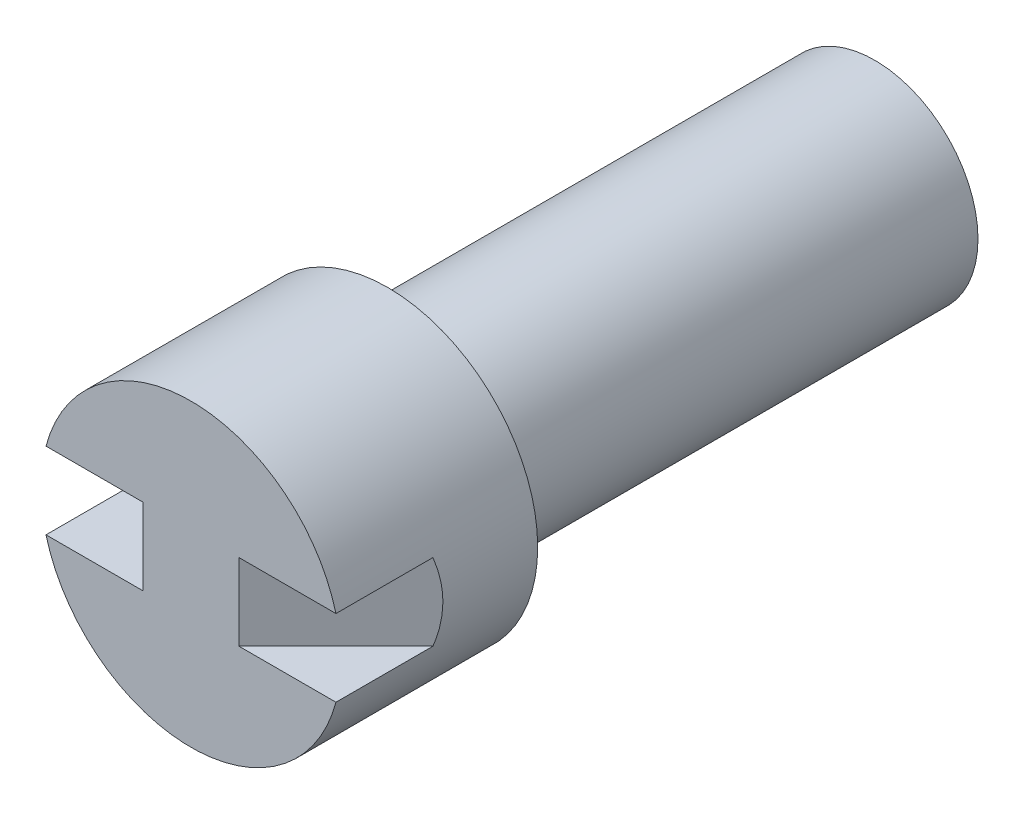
ISO-10303-21;
HEADER;
FILE_DESCRIPTION(('STEP AP214'),'2;1');
FILE_NAME('part.step','',(''),(''),'','','');
FILE_SCHEMA(('AUTOMOTIVE_DESIGN { 1 0 10303 214 1 1 1 1 }'));
ENDSEC;
DATA;
#1=APPLICATION_CONTEXT('core data for automotive mechanical design processes');
#2=APPLICATION_PROTOCOL_DEFINITION('international standard','automotive_design',2000,#1);
#3=PRODUCT_CONTEXT('',#1,'mechanical');
#4=PRODUCT('Part','Part','',(#3));
#5=PRODUCT_RELATED_PRODUCT_CATEGORY('part','',(#4));
#6=PRODUCT_DEFINITION_FORMATION('','',#4);
#7=PRODUCT_DEFINITION_CONTEXT('part definition',#1,'design');
#8=PRODUCT_DEFINITION('design','',#6,#7);
#9=PRODUCT_DEFINITION_SHAPE('','',#8);
#10=(LENGTH_UNIT() NAMED_UNIT(*) SI_UNIT(.MILLI.,.METRE.));
#11=(NAMED_UNIT(*) PLANE_ANGLE_UNIT() SI_UNIT($,.RADIAN.));
#12=(NAMED_UNIT(*) SI_UNIT($,.STERADIAN.) SOLID_ANGLE_UNIT());
#13=UNCERTAINTY_MEASURE_WITH_UNIT(LENGTH_MEASURE(1.E-05),#10,'distance_accuracy_value','');
#14=(GEOMETRIC_REPRESENTATION_CONTEXT(3) GLOBAL_UNCERTAINTY_ASSIGNED_CONTEXT((#13)) GLOBAL_UNIT_ASSIGNED_CONTEXT((#10,
#11,#12)) REPRESENTATION_CONTEXT('',''));
#15=CARTESIAN_POINT('',(0.,0.,0.));
#16=DIRECTION('',(0.,0.,1.));
#17=DIRECTION('',(1.,0.,0.));
#18=AXIS2_PLACEMENT_3D('',#15,#16,#17);
#19=CARTESIAN_POINT('',(0.,0.,0.));
#20=DIRECTION('',(0.,0.,-1.));
#21=DIRECTION('',(-1.,0.,0.));
#22=AXIS2_PLACEMENT_3D('',#19,#20,#21);
#23=PLANE('',#22);
#24=DIRECTION('',(1.,0.,0.));
#25=VECTOR('',#24,1.);
#26=CARTESIAN_POINT('',(0.508,-0.4064,0.));
#27=LINE('',#26,#25);
#28=CARTESIAN_POINT('',(0.508,-0.4064,0.));
#29=VERTEX_POINT('',#28);
#30=CARTESIAN_POINT('',(1.53459939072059,-0.4064,0.));
#31=VERTEX_POINT('',#30);
#32=EDGE_CURVE('E92',#29,#31,#27,.T.);
#33=ORIENTED_EDGE('',*,*,#32,.F.);
#34=DIRECTION('',(0.,1.,0.));
#35=VECTOR('',#34,1.);
#36=CARTESIAN_POINT('',(0.508,-0.4064,0.));
#37=LINE('',#36,#35);
#38=CARTESIAN_POINT('',(0.508,0.4064,0.));
#39=VERTEX_POINT('',#38);
#40=EDGE_CURVE('E98',#29,#39,#37,.T.);
#41=ORIENTED_EDGE('',*,*,#40,.T.);
#42=DIRECTION('',(1.,0.,0.));
#43=VECTOR('',#42,1.);
#44=CARTESIAN_POINT('',(0.508,0.4064,0.));
#45=LINE('',#44,#43);
#46=CARTESIAN_POINT('',(1.53459939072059,0.4064,0.));
#47=VERTEX_POINT('',#46);
#48=EDGE_CURVE('E95',#39,#47,#45,.T.);
#49=ORIENTED_EDGE('',*,*,#48,.T.);
#50=CARTESIAN_POINT('',(0.,0.,0.));
#51=DIRECTION('',(0.,0.,1.));
#52=DIRECTION('',(1.,0.,0.));
#53=AXIS2_PLACEMENT_3D('',#50,#51,#52);
#54=CIRCLE('',#53,1.5875);
#55=CARTESIAN_POINT('',(-1.53459939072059,0.4064,0.));
#56=VERTEX_POINT('',#55);
#57=EDGE_CURVE('E57',#47,#56,#54,.T.);
#58=ORIENTED_EDGE('',*,*,#57,.T.);
#59=DIRECTION('',(1.,0.,0.));
#60=VECTOR('',#59,1.);
#61=CARTESIAN_POINT('',(-1.5875,0.4064,0.));
#62=LINE('',#61,#60);
#63=CARTESIAN_POINT('',(-0.508,0.4064,0.));
#64=VERTEX_POINT('',#63);
#65=EDGE_CURVE('E100',#56,#64,#62,.T.);
#66=ORIENTED_EDGE('',*,*,#65,.T.);
#67=DIRECTION('',(0.,1.,0.));
#68=VECTOR('',#67,1.);
#69=CARTESIAN_POINT('',(-0.508,-0.4064,0.));
#70=LINE('',#69,#68);
#71=CARTESIAN_POINT('',(-0.508,-0.4064,0.));
#72=VERTEX_POINT('',#71);
#73=EDGE_CURVE('E116',#72,#64,#70,.T.);
#74=ORIENTED_EDGE('',*,*,#73,.F.);
#75=DIRECTION('',(1.,0.,0.));
#76=VECTOR('',#75,1.);
#77=CARTESIAN_POINT('',(-1.5875,-0.4064,0.));
#78=LINE('',#77,#76);
#79=CARTESIAN_POINT('',(-1.53459939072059,-0.4064,0.));
#80=VERTEX_POINT('',#79);
#81=EDGE_CURVE('E110',#80,#72,#78,.T.);
#82=ORIENTED_EDGE('',*,*,#81,.F.);
#83=EDGE_CURVE('E105',#80,#31,#54,.T.);
#84=ORIENTED_EDGE('',*,*,#83,.T.);
#85=EDGE_LOOP('',(#33,#41,#49,#58,#66,#74,#82,#84));
#86=FACE_BOUND('',#85,.T.);
#87=ADVANCED_FACE('F35',(#86),#23,.F.);
#88=CARTESIAN_POINT('',(0.,0.,0.));
#89=DIRECTION('',(0.,0.,1.));
#90=DIRECTION('',(1.,0.,0.));
#91=AXIS2_PLACEMENT_3D('',#88,#89,#90);
#92=CYLINDRICAL_SURFACE('',#91,1.5875);
#93=CARTESIAN_POINT('',(0.,0.,0.508000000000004));
#94=DIRECTION('',(-0.70710678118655,0.,-0.707106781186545));
#95=DIRECTION('',(-0.707106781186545,0.,0.70710678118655));
#96=AXIS2_PLACEMENT_3D('',#93,#94,#95);
#97=ELLIPSE('',#96,2.2450640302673,1.5875);
#98=CARTESIAN_POINT('',(1.53459939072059,0.4064,-1.0265993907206));
#99=VERTEX_POINT('',#98);
#100=CARTESIAN_POINT('',(1.53459939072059,-0.4064,-1.0265993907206));
#101=VERTEX_POINT('',#100);
#102=EDGE_CURVE('E42',#99,#101,#97,.T.);
#103=ORIENTED_EDGE('',*,*,#102,.T.);
#104=DIRECTION('',(0.,0.,1.));
#105=VECTOR('',#104,1.);
#106=CARTESIAN_POINT('',(1.53459939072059,-0.4064,0.));
#107=LINE('',#106,#105);
#108=EDGE_CURVE('E11',#31,#101,#107,.F.);
#109=ORIENTED_EDGE('',*,*,#108,.F.);
#110=ORIENTED_EDGE('',*,*,#83,.F.);
#111=DIRECTION('',(0.,0.,1.));
#112=VECTOR('',#111,1.);
#113=CARTESIAN_POINT('',(-1.53459939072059,-0.4064,0.));
#114=LINE('',#113,#112);
#115=CARTESIAN_POINT('',(-1.53459939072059,-0.4064,-1.0265993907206));
#116=VERTEX_POINT('',#115);
#117=EDGE_CURVE('E136',#80,#116,#114,.F.);
#118=ORIENTED_EDGE('',*,*,#117,.T.);
#119=CARTESIAN_POINT('',(0.,0.,0.508000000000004));
#120=DIRECTION('',(0.70710678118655,0.,-0.707106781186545));
#121=DIRECTION('',(0.707106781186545,0.,0.70710678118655));
#122=AXIS2_PLACEMENT_3D('',#119,#120,#121);
#123=ELLIPSE('',#122,2.2450640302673,1.5875);
#124=CARTESIAN_POINT('',(-1.53459939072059,0.4064,-1.0265993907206));
#125=VERTEX_POINT('',#124);
#126=EDGE_CURVE('E133',#116,#125,#123,.T.);
#127=ORIENTED_EDGE('',*,*,#126,.T.);
#128=DIRECTION('',(0.,0.,1.));
#129=VECTOR('',#128,1.);
#130=CARTESIAN_POINT('',(-1.53459939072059,0.4064,0.));
#131=LINE('',#130,#129);
#132=EDGE_CURVE('E131',#56,#125,#131,.F.);
#133=ORIENTED_EDGE('',*,*,#132,.F.);
#134=ORIENTED_EDGE('',*,*,#57,.F.);
#135=DIRECTION('',(0.,0.,1.));
#136=VECTOR('',#135,1.);
#137=CARTESIAN_POINT('',(1.53459939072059,0.4064,0.));
#138=LINE('',#137,#136);
#139=EDGE_CURVE('E139',#47,#99,#138,.F.);
#140=ORIENTED_EDGE('',*,*,#139,.T.);
#141=EDGE_LOOP('',(#103,#109,#110,#118,#127,#133,#134,#140));
#142=FACE_BOUND('',#141,.T.);
#143=CARTESIAN_POINT('',(0.,0.,-2.0828));
#144=DIRECTION('',(0.,0.,1.));
#145=DIRECTION('',(1.,0.,0.));
#146=AXIS2_PLACEMENT_3D('',#143,#144,#145);
#147=CIRCLE('',#146,1.5875);
#148=CARTESIAN_POINT('',(1.5875,0.,-2.0828));
#149=VERTEX_POINT('',#148);
#150=EDGE_CURVE('E127',#149,#149,#147,.T.);
#151=ORIENTED_EDGE('',*,*,#150,.T.);
#152=EDGE_LOOP('',(#151));
#153=FACE_BOUND('',#152,.T.);
#154=ADVANCED_FACE('F142',(#142,#153),#92,.T.);
#155=CARTESIAN_POINT('',(0.,1.5875,-2.0828));
#156=DIRECTION('',(0.,0.,1.));
#157=DIRECTION('',(1.,0.,0.));
#158=AXIS2_PLACEMENT_3D('',#155,#156,#157);
#159=PLANE('',#158);
#160=ORIENTED_EDGE('',*,*,#150,.F.);
#161=EDGE_LOOP('',(#160));
#162=FACE_BOUND('',#161,.T.);
#163=CARTESIAN_POINT('',(0.,0.,-2.0828));
#164=DIRECTION('',(0.,0.,1.));
#165=DIRECTION('',(1.,0.,0.));
#166=AXIS2_PLACEMENT_3D('',#163,#164,#165);
#167=CIRCLE('',#166,1.0922);
#168=CARTESIAN_POINT('',(1.0922,0.,-2.0828));
#169=VERTEX_POINT('',#168);
#170=EDGE_CURVE('E124',#169,#169,#167,.T.);
#171=ORIENTED_EDGE('',*,*,#170,.T.);
#172=EDGE_LOOP('',(#171));
#173=FACE_BOUND('',#172,.T.);
#174=ADVANCED_FACE('F157',(#162,#173),#159,.F.);
#175=CARTESIAN_POINT('',(0.,0.,0.));
#176=DIRECTION('',(0.,0.,1.));
#177=DIRECTION('',(1.,0.,0.));
#178=AXIS2_PLACEMENT_3D('',#175,#176,#177);
#179=CYLINDRICAL_SURFACE('',#178,1.0922);
#180=ORIENTED_EDGE('',*,*,#170,.F.);
#181=EDGE_LOOP('',(#180));
#182=FACE_BOUND('',#181,.T.);
#183=CARTESIAN_POINT('',(0.,0.,-7.239));
#184=DIRECTION('',(0.,0.,1.));
#185=DIRECTION('',(1.,0.,0.));
#186=AXIS2_PLACEMENT_3D('',#183,#184,#185);
#187=CIRCLE('',#186,1.0922);
#188=CARTESIAN_POINT('',(1.0922,0.,-7.239));
#189=VERTEX_POINT('',#188);
#190=EDGE_CURVE('E121',#189,#189,#187,.T.);
#191=ORIENTED_EDGE('',*,*,#190,.T.);
#192=EDGE_LOOP('',(#191));
#193=FACE_BOUND('',#192,.T.);
#194=ADVANCED_FACE('F161',(#182,#193),#179,.T.);
#195=CARTESIAN_POINT('',(0.,1.0922,-7.239));
#196=DIRECTION('',(0.,0.,1.));
#197=DIRECTION('',(1.,0.,0.));
#198=AXIS2_PLACEMENT_3D('',#195,#196,#197);
#199=PLANE('',#198);
#200=ORIENTED_EDGE('',*,*,#190,.F.);
#201=EDGE_LOOP('',(#200));
#202=FACE_BOUND('',#201,.T.);
#203=ADVANCED_FACE('F167',(#202),#199,.F.);
#204=CARTESIAN_POINT('',(-0.508,-0.4064,0.));
#205=DIRECTION('',(0.70710678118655,0.,-0.707106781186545));
#206=DIRECTION('',(-0.707106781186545,0.,-0.70710678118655));
#207=AXIS2_PLACEMENT_3D('',#204,#205,#206);
#208=PLANE('',#207);
#209=DIRECTION('',(-0.707106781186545,0.,-0.70710678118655));
#210=VECTOR('',#209,1.);
#211=CARTESIAN_POINT('',(-0.508,-0.4064,0.));
#212=LINE('',#211,#210);
#213=EDGE_CURVE('E112',#72,#116,#212,.T.);
#214=ORIENTED_EDGE('',*,*,#213,.F.);
#215=ORIENTED_EDGE('',*,*,#73,.T.);
#216=DIRECTION('',(-0.707106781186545,0.,-0.70710678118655));
#217=VECTOR('',#216,1.);
#218=CARTESIAN_POINT('',(-0.508,0.4064,0.));
#219=LINE('',#218,#217);
#220=EDGE_CURVE('E113',#64,#125,#219,.T.);
#221=ORIENTED_EDGE('',*,*,#220,.T.);
#222=ORIENTED_EDGE('',*,*,#126,.F.);
#223=EDGE_LOOP('',(#214,#215,#221,#222));
#224=FACE_BOUND('',#223,.T.);
#225=ADVANCED_FACE('F171',(#224),#208,.F.);
#226=CARTESIAN_POINT('',(0.,-0.4064,0.));
#227=DIRECTION('',(0.,-1.,0.));
#228=DIRECTION('',(0.,0.,-1.));
#229=AXIS2_PLACEMENT_3D('',#226,#227,#228);
#230=PLANE('',#229);
#231=ORIENTED_EDGE('',*,*,#81,.T.);
#232=ORIENTED_EDGE('',*,*,#213,.T.);
#233=ORIENTED_EDGE('',*,*,#117,.F.);
#234=EDGE_LOOP('',(#231,#232,#233));
#235=FACE_BOUND('',#234,.T.);
#236=ADVANCED_FACE('F175',(#235),#230,.F.);
#237=CARTESIAN_POINT('',(0.,0.4064,0.));
#238=DIRECTION('',(0.,-1.,0.));
#239=DIRECTION('',(0.,0.,-1.));
#240=AXIS2_PLACEMENT_3D('',#237,#238,#239);
#241=PLANE('',#240);
#242=ORIENTED_EDGE('',*,*,#132,.T.);
#243=ORIENTED_EDGE('',*,*,#220,.F.);
#244=ORIENTED_EDGE('',*,*,#65,.F.);
#245=EDGE_LOOP('',(#242,#243,#244));
#246=FACE_BOUND('',#245,.T.);
#247=ADVANCED_FACE('F177',(#246),#241,.T.);
#248=CARTESIAN_POINT('',(1.5875,-0.4064,-1.07950000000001));
#249=DIRECTION('',(-0.70710678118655,0.,-0.707106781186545));
#250=DIRECTION('',(-0.707106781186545,0.,0.70710678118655));
#251=AXIS2_PLACEMENT_3D('',#248,#249,#250);
#252=PLANE('',#251);
#253=DIRECTION('',(-0.707106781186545,0.,0.70710678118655));
#254=VECTOR('',#253,1.);
#255=CARTESIAN_POINT('',(1.5875,0.4064,-1.07950000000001));
#256=LINE('',#255,#254);
#257=EDGE_CURVE('E49',#99,#39,#256,.T.);
#258=ORIENTED_EDGE('',*,*,#257,.T.);
#259=ORIENTED_EDGE('',*,*,#40,.F.);
#260=DIRECTION('',(-0.707106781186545,0.,0.70710678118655));
#261=VECTOR('',#260,1.);
#262=CARTESIAN_POINT('',(1.5875,-0.4064,-1.07950000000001));
#263=LINE('',#262,#261);
#264=EDGE_CURVE('E88',#101,#29,#263,.T.);
#265=ORIENTED_EDGE('',*,*,#264,.F.);
#266=ORIENTED_EDGE('',*,*,#102,.F.);
#267=EDGE_LOOP('',(#258,#259,#265,#266));
#268=FACE_BOUND('',#267,.T.);
#269=ADVANCED_FACE('F99',(#268),#252,.F.);
#270=CARTESIAN_POINT('',(0.,-0.4064,0.));
#271=DIRECTION('',(0.,1.,0.));
#272=DIRECTION('',(0.,0.,1.));
#273=AXIS2_PLACEMENT_3D('',#270,#271,#272);
#274=PLANE('',#273);
#275=ORIENTED_EDGE('',*,*,#108,.T.);
#276=ORIENTED_EDGE('',*,*,#264,.T.);
#277=ORIENTED_EDGE('',*,*,#32,.T.);
#278=EDGE_LOOP('',(#275,#276,#277));
#279=FACE_BOUND('',#278,.T.);
#280=ADVANCED_FACE('F90',(#279),#274,.T.);
#281=CARTESIAN_POINT('',(0.,0.4064,0.));
#282=DIRECTION('',(0.,1.,0.));
#283=DIRECTION('',(0.,0.,1.));
#284=AXIS2_PLACEMENT_3D('',#281,#282,#283);
#285=PLANE('',#284);
#286=ORIENTED_EDGE('',*,*,#48,.F.);
#287=ORIENTED_EDGE('',*,*,#257,.F.);
#288=ORIENTED_EDGE('',*,*,#139,.F.);
#289=EDGE_LOOP('',(#286,#287,#288));
#290=FACE_BOUND('',#289,.T.);
#291=ADVANCED_FACE('F145',(#290),#285,.F.);
#292=CLOSED_SHELL('',(#87,#154,#174,#194,#203,#225,#236,#247,#269,#280,#291));
#293=MANIFOLD_SOLID_BREP('B2',#292);
#294=ADVANCED_BREP_SHAPE_REPRESENTATION('',(#18,#293),#14);
#295=SHAPE_DEFINITION_REPRESENTATION(#9,#294);
ENDSEC;
END-ISO-10303-21;
